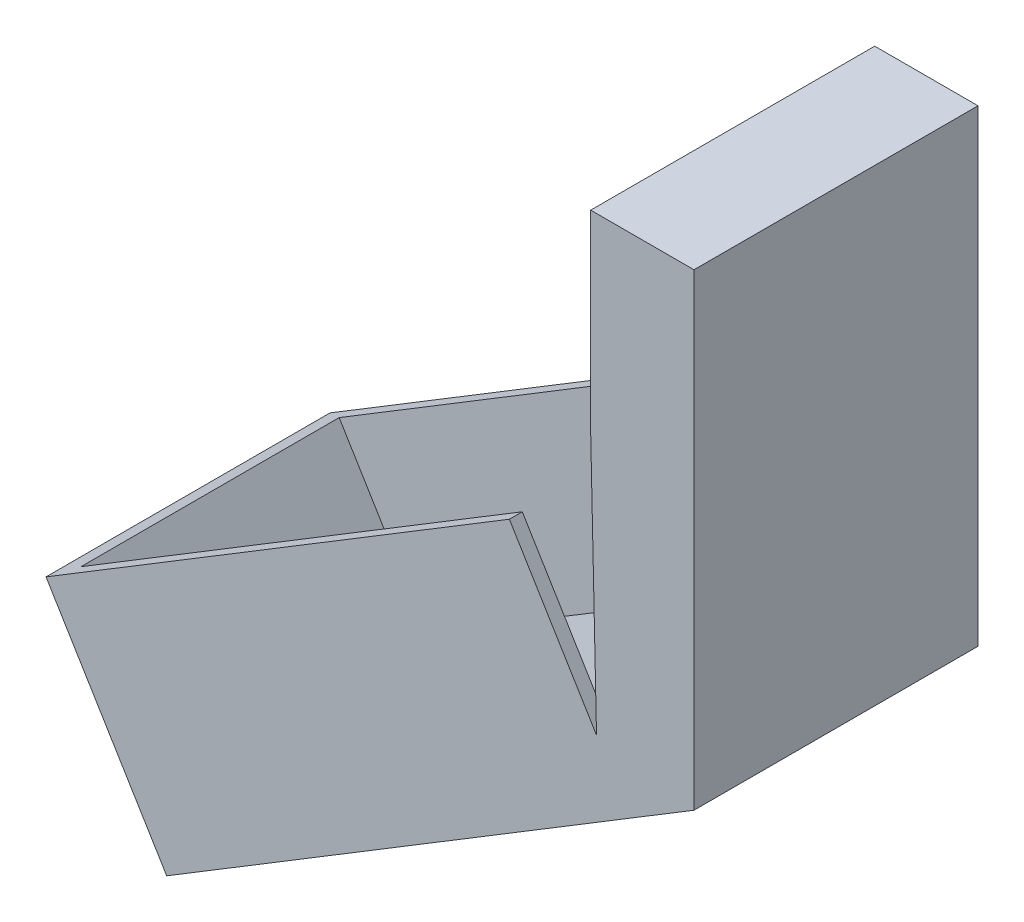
ISO-10303-21;
HEADER;
FILE_DESCRIPTION(('STEP AP214'),'2;1');
FILE_NAME('part.step','',(''),(''),'','','');
FILE_SCHEMA(('AUTOMOTIVE_DESIGN { 1 0 10303 214 1 1 1 1 }'));
ENDSEC;
DATA;
#1=APPLICATION_CONTEXT('core data for automotive mechanical design processes');
#2=APPLICATION_PROTOCOL_DEFINITION('international standard','automotive_design',2000,#1);
#3=PRODUCT_CONTEXT('',#1,'mechanical');
#4=PRODUCT('Part','Part','',(#3));
#5=PRODUCT_RELATED_PRODUCT_CATEGORY('part','',(#4));
#6=PRODUCT_DEFINITION_FORMATION('','',#4);
#7=PRODUCT_DEFINITION_CONTEXT('part definition',#1,'design');
#8=PRODUCT_DEFINITION('design','',#6,#7);
#9=PRODUCT_DEFINITION_SHAPE('','',#8);
#10=(LENGTH_UNIT() NAMED_UNIT(*) SI_UNIT(.MILLI.,.METRE.));
#11=(NAMED_UNIT(*) PLANE_ANGLE_UNIT() SI_UNIT($,.RADIAN.));
#12=(NAMED_UNIT(*) SI_UNIT($,.STERADIAN.) SOLID_ANGLE_UNIT());
#13=UNCERTAINTY_MEASURE_WITH_UNIT(LENGTH_MEASURE(1.E-05),#10,'distance_accuracy_value','');
#14=(GEOMETRIC_REPRESENTATION_CONTEXT(3) GLOBAL_UNCERTAINTY_ASSIGNED_CONTEXT((#13)) GLOBAL_UNIT_ASSIGNED_CONTEXT((#10,
#11,#12)) REPRESENTATION_CONTEXT('',''));
#15=CARTESIAN_POINT('',(0.,0.,0.));
#16=DIRECTION('',(0.,0.,1.));
#17=DIRECTION('',(1.,0.,0.));
#18=AXIS2_PLACEMENT_3D('',#15,#16,#17);
#19=CARTESIAN_POINT('',(0.449712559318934,-19.994943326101,22.));
#20=DIRECTION('',(0.519346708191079,-0.854563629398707,0.));
#21=DIRECTION('',(0.854563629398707,0.519346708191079,0.));
#22=AXIS2_PLACEMENT_3D('',#19,#20,#21);
#23=PLANE('',#22);
#24=DIRECTION('',(-0.854563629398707,-0.519346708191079,0.));
#25=VECTOR('',#24,1.);
#26=CARTESIAN_POINT('',(-33.7328326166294,-40.7688116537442,21.));
#27=LINE('',#26,#25);
#28=CARTESIAN_POINT('',(0.449712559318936,-19.994943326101,21.));
#29=VERTEX_POINT('',#28);
#30=CARTESIAN_POINT('',(-33.7328326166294,-40.7688116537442,21.));
#31=VERTEX_POINT('',#30);
#32=EDGE_CURVE('E157',#29,#31,#27,.T.);
#33=ORIENTED_EDGE('',*,*,#32,.F.);
#34=DIRECTION('',(0.,0.,-1.));
#35=VECTOR('',#34,1.);
#36=CARTESIAN_POINT('',(0.449712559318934,-19.994943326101,22.));
#37=LINE('',#36,#35);
#38=CARTESIAN_POINT('',(0.449712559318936,-19.994943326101,1.));
#39=VERTEX_POINT('',#38);
#40=EDGE_CURVE('E221',#29,#39,#37,.T.);
#41=ORIENTED_EDGE('',*,*,#40,.T.);
#42=DIRECTION('',(0.854563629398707,0.519346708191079,0.));
#43=VECTOR('',#42,1.);
#44=CARTESIAN_POINT('',(0.449712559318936,-19.994943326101,1.));
#45=LINE('',#44,#43);
#46=CARTESIAN_POINT('',(-33.7328326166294,-40.7688116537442,1.));
#47=VERTEX_POINT('',#46);
#48=EDGE_CURVE('E168',#47,#39,#45,.T.);
#49=ORIENTED_EDGE('',*,*,#48,.F.);
#50=DIRECTION('',(0.,0.,-1.));
#51=VECTOR('',#50,1.);
#52=CARTESIAN_POINT('',(-33.7328326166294,-40.7688116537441,22.));
#53=LINE('',#52,#51);
#54=EDGE_CURVE('E220',#31,#47,#53,.T.);
#55=ORIENTED_EDGE('',*,*,#54,.F.);
#56=EDGE_LOOP('',(#33,#41,#49,#55));
#57=FACE_BOUND('',#56,.T.);
#58=ADVANCED_FACE('F37',(#57),#23,.F.);
#59=CARTESIAN_POINT('',(-33.7328326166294,-40.7688116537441,22.));
#60=DIRECTION('',(-0.854563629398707,-0.519346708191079,0.));
#61=DIRECTION('',(0.519346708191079,-0.854563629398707,0.));
#62=AXIS2_PLACEMENT_3D('',#59,#60,#61);
#63=PLANE('',#62);
#64=DIRECTION('',(0.519346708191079,-0.854563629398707,0.));
#65=VECTOR('',#64,1.);
#66=CARTESIAN_POINT('',(-40.4843398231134,-29.659484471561,21.));
#67=LINE('',#66,#65);
#68=CARTESIAN_POINT('',(-40.4843398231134,-29.659484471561,21.));
#69=VERTEX_POINT('',#68);
#70=EDGE_CURVE('E52',#69,#31,#67,.T.);
#71=ORIENTED_EDGE('',*,*,#70,.T.);
#72=ORIENTED_EDGE('',*,*,#54,.T.);
#73=DIRECTION('',(0.519346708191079,-0.854563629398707,0.));
#74=VECTOR('',#73,1.);
#75=CARTESIAN_POINT('',(-40.4843398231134,-29.659484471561,1.));
#76=LINE('',#75,#74);
#77=CARTESIAN_POINT('',(-40.4843398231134,-29.659484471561,1.));
#78=VERTEX_POINT('',#77);
#79=EDGE_CURVE('E177',#78,#47,#76,.T.);
#80=ORIENTED_EDGE('',*,*,#79,.F.);
#81=DIRECTION('',(0.,0.,-1.));
#82=VECTOR('',#81,1.);
#83=CARTESIAN_POINT('',(-40.4843398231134,-29.659484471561,0.));
#84=LINE('',#83,#82);
#85=EDGE_CURVE('E182',#69,#78,#84,.T.);
#86=ORIENTED_EDGE('',*,*,#85,.F.);
#87=EDGE_LOOP('',(#71,#72,#80,#86));
#88=FACE_BOUND('',#87,.T.);
#89=ADVANCED_FACE('F245',(#88),#63,.F.);
#90=CARTESIAN_POINT('',(0.,0.,22.));
#91=DIRECTION('',(0.99974716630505,0.0224856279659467,0.));
#92=DIRECTION('',(-0.0224856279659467,0.99974716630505,0.));
#93=AXIS2_PLACEMENT_3D('',#90,#91,#92);
#94=PLANE('',#93);
#95=DIRECTION('',(0.0224856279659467,-0.99974716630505,0.));
#96=VECTOR('',#95,1.);
#97=CARTESIAN_POINT('',(0.,0.,0.));
#98=LINE('',#97,#96);
#99=CARTESIAN_POINT('',(0.,0.,0.));
#100=VERTEX_POINT('',#99);
#101=CARTESIAN_POINT('',(0.449712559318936,-19.994943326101,0.));
#102=VERTEX_POINT('',#101);
#103=EDGE_CURVE('E202',#100,#102,#98,.T.);
#104=ORIENTED_EDGE('',*,*,#103,.T.);
#105=DIRECTION('',(0.,0.,-1.));
#106=VECTOR('',#105,1.);
#107=CARTESIAN_POINT('',(0.449712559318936,-19.994943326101,0.));
#108=LINE('',#107,#106);
#109=EDGE_CURVE('E151',#39,#102,#108,.T.);
#110=ORIENTED_EDGE('',*,*,#109,.F.);
#111=ORIENTED_EDGE('',*,*,#40,.F.);
#112=CARTESIAN_POINT('',(0.449712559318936,-19.994943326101,22.));
#113=VERTEX_POINT('',#112);
#114=EDGE_CURVE('E45',#113,#29,#37,.T.);
#115=ORIENTED_EDGE('',*,*,#114,.F.);
#116=DIRECTION('',(0.0224856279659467,-0.99974716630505,0.));
#117=VECTOR('',#116,1.);
#118=CARTESIAN_POINT('',(0.,0.,22.));
#119=LINE('',#118,#117);
#120=CARTESIAN_POINT('',(0.,0.,22.));
#121=VERTEX_POINT('',#120);
#122=EDGE_CURVE('E84',#121,#113,#119,.T.);
#123=ORIENTED_EDGE('',*,*,#122,.F.);
#124=DIRECTION('',(0.,0.,-1.));
#125=VECTOR('',#124,1.);
#126=CARTESIAN_POINT('',(0.,0.,22.));
#127=LINE('',#126,#125);
#128=EDGE_CURVE('E11',#121,#100,#127,.T.);
#129=ORIENTED_EDGE('',*,*,#128,.T.);
#130=EDGE_LOOP('',(#104,#110,#111,#115,#123,#129));
#131=FACE_BOUND('',#130,.T.);
#132=ADVANCED_FACE('F39',(#131),#94,.F.);
#133=CARTESIAN_POINT('',(-37.,-39.2438141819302,22.));
#134=DIRECTION('',(0.854563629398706,0.51934670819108,0.));
#135=DIRECTION('',(-0.51934670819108,0.854563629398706,0.));
#136=AXIS2_PLACEMENT_3D('',#133,#134,#135);
#137=PLANE('',#136);
#138=DIRECTION('',(0.51934670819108,-0.854563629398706,0.));
#139=VECTOR('',#138,1.);
#140=CARTESIAN_POINT('',(-37.,-39.2438141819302,0.));
#141=LINE('',#140,#139);
#142=CARTESIAN_POINT('',(-42.1934670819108,-30.6981778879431,0.));
#143=VERTEX_POINT('',#142);
#144=CARTESIAN_POINT('',(-32.8452263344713,-46.0803232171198,0.));
#145=VERTEX_POINT('',#144);
#146=EDGE_CURVE('E213',#143,#145,#141,.T.);
#147=ORIENTED_EDGE('',*,*,#146,.T.);
#148=DIRECTION('',(0.,0.,-1.));
#149=VECTOR('',#148,1.);
#150=CARTESIAN_POINT('',(-32.8452263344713,-46.0803232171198,22.));
#151=LINE('',#150,#149);
#152=CARTESIAN_POINT('',(-32.8452263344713,-46.0803232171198,22.));
#153=VERTEX_POINT('',#152);
#154=EDGE_CURVE('E218',#153,#145,#151,.T.);
#155=ORIENTED_EDGE('',*,*,#154,.F.);
#156=DIRECTION('',(0.51934670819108,-0.854563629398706,0.));
#157=VECTOR('',#156,1.);
#158=CARTESIAN_POINT('',(-37.,-39.2438141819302,22.));
#159=LINE('',#158,#157);
#160=CARTESIAN_POINT('',(-42.1934670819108,-30.6981778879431,22.));
#161=VERTEX_POINT('',#160);
#162=EDGE_CURVE('E204',#161,#153,#159,.T.);
#163=ORIENTED_EDGE('',*,*,#162,.F.);
#164=DIRECTION('',(0.,0.,1.));
#165=VECTOR('',#164,1.);
#166=CARTESIAN_POINT('',(-42.1934670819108,-30.6981778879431,0.));
#167=LINE('',#166,#165);
#168=EDGE_CURVE('E145',#143,#161,#167,.T.);
#169=ORIENTED_EDGE('',*,*,#168,.F.);
#170=EDGE_LOOP('',(#147,#155,#163,#169));
#171=FACE_BOUND('',#170,.T.);
#172=ADVANCED_FACE('F252',(#171),#137,.F.);
#173=CARTESIAN_POINT('',(-32.8452263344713,-46.0803232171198,22.));
#174=DIRECTION('',(-0.519346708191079,0.854563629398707,0.));
#175=DIRECTION('',(-0.854563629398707,-0.519346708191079,0.));
#176=AXIS2_PLACEMENT_3D('',#173,#174,#175);
#177=PLANE('',#176);
#178=DIRECTION('',(0.854563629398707,0.519346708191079,0.));
#179=VECTOR('',#178,1.);
#180=CARTESIAN_POINT('',(-32.8452263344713,-46.0803232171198,0.));
#181=LINE('',#180,#179);
#182=CARTESIAN_POINT('',(8.,-21.2573221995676,0.));
#183=VERTEX_POINT('',#182);
#184=EDGE_CURVE('E78',#145,#183,#181,.T.);
#185=ORIENTED_EDGE('',*,*,#184,.T.);
#186=DIRECTION('',(0.,0.,-1.));
#187=VECTOR('',#186,1.);
#188=CARTESIAN_POINT('',(8.,-21.2573221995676,22.));
#189=LINE('',#188,#187);
#190=CARTESIAN_POINT('',(8.,-21.2573221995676,22.));
#191=VERTEX_POINT('',#190);
#192=EDGE_CURVE('E210',#191,#183,#189,.T.);
#193=ORIENTED_EDGE('',*,*,#192,.F.);
#194=DIRECTION('',(0.854563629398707,0.519346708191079,0.));
#195=VECTOR('',#194,1.);
#196=CARTESIAN_POINT('',(-32.8452263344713,-46.0803232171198,22.));
#197=LINE('',#196,#195);
#198=EDGE_CURVE('E61',#153,#191,#197,.T.);
#199=ORIENTED_EDGE('',*,*,#198,.F.);
#200=ORIENTED_EDGE('',*,*,#154,.T.);
#201=EDGE_LOOP('',(#185,#193,#199,#200));
#202=FACE_BOUND('',#201,.T.);
#203=ADVANCED_FACE('F256',(#202),#177,.F.);
#204=CARTESIAN_POINT('',(8.,-21.2573221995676,22.));
#205=DIRECTION('',(-1.,0.,0.));
#206=DIRECTION('',(0.,0.,1.));
#207=AXIS2_PLACEMENT_3D('',#204,#205,#206);
#208=PLANE('',#207);
#209=DIRECTION('',(0.,1.,0.));
#210=VECTOR('',#209,1.);
#211=CARTESIAN_POINT('',(8.,-21.2573221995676,0.));
#212=LINE('',#211,#210);
#213=CARTESIAN_POINT('',(8.,15.,0.));
#214=VERTEX_POINT('',#213);
#215=EDGE_CURVE('E205',#183,#214,#212,.T.);
#216=ORIENTED_EDGE('',*,*,#215,.T.);
#217=DIRECTION('',(0.,0.,-1.));
#218=VECTOR('',#217,1.);
#219=CARTESIAN_POINT('',(8.,15.,0.));
#220=LINE('',#219,#218);
#221=CARTESIAN_POINT('',(8.,15.,22.));
#222=VERTEX_POINT('',#221);
#223=EDGE_CURVE('E192',#222,#214,#220,.T.);
#224=ORIENTED_EDGE('',*,*,#223,.F.);
#225=DIRECTION('',(0.,1.,0.));
#226=VECTOR('',#225,1.);
#227=CARTESIAN_POINT('',(8.,-21.2573221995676,22.));
#228=LINE('',#227,#226);
#229=EDGE_CURVE('E208',#191,#222,#228,.T.);
#230=ORIENTED_EDGE('',*,*,#229,.F.);
#231=ORIENTED_EDGE('',*,*,#192,.T.);
#232=EDGE_LOOP('',(#216,#224,#230,#231));
#233=FACE_BOUND('',#232,.T.);
#234=ADVANCED_FACE('F260',(#233),#208,.F.);
#235=CARTESIAN_POINT('',(0.,0.,22.));
#236=DIRECTION('',(0.,0.,-1.));
#237=DIRECTION('',(-1.,0.,0.));
#238=AXIS2_PLACEMENT_3D('',#235,#236,#237);
#239=PLANE('',#238);
#240=DIRECTION('',(0.519346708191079,-0.854563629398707,0.));
#241=VECTOR('',#240,1.);
#242=CARTESIAN_POINT('',(-6.30179464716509,-8.88561614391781,22.));
#243=LINE('',#242,#241);
#244=CARTESIAN_POINT('',(-6.30179464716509,-8.88561614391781,22.));
#245=VERTEX_POINT('',#244);
#246=EDGE_CURVE('E148',#245,#113,#243,.T.);
#247=ORIENTED_EDGE('',*,*,#246,.F.);
#248=DIRECTION('',(0.854563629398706,0.519346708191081,0.));
#249=VECTOR('',#248,1.);
#250=CARTESIAN_POINT('',(-40.4843398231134,-29.659484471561,22.));
#251=LINE('',#250,#249);
#252=EDGE_CURVE('E137',#161,#245,#251,.T.);
#253=ORIENTED_EDGE('',*,*,#252,.F.);
#254=ORIENTED_EDGE('',*,*,#162,.T.);
#255=ORIENTED_EDGE('',*,*,#198,.T.);
#256=ORIENTED_EDGE('',*,*,#229,.T.);
#257=DIRECTION('',(1.,0.,0.));
#258=VECTOR('',#257,1.);
#259=CARTESIAN_POINT('',(0.,15.,22.));
#260=LINE('',#259,#258);
#261=CARTESIAN_POINT('',(0.,15.,22.));
#262=VERTEX_POINT('',#261);
#263=EDGE_CURVE('E189',#262,#222,#260,.T.);
#264=ORIENTED_EDGE('',*,*,#263,.F.);
#265=DIRECTION('',(0.,-1.,0.));
#266=VECTOR('',#265,1.);
#267=CARTESIAN_POINT('',(0.,15.,22.));
#268=LINE('',#267,#266);
#269=EDGE_CURVE('E200',#262,#121,#268,.T.);
#270=ORIENTED_EDGE('',*,*,#269,.T.);
#271=ORIENTED_EDGE('',*,*,#122,.T.);
#272=EDGE_LOOP('',(#247,#253,#254,#255,#256,#264,#270,#271));
#273=FACE_BOUND('',#272,.T.);
#274=ADVANCED_FACE('F149',(#273),#239,.F.);
#275=CARTESIAN_POINT('',(0.,0.,0.));
#276=DIRECTION('',(0.,0.,-1.));
#277=DIRECTION('',(-1.,0.,0.));
#278=AXIS2_PLACEMENT_3D('',#275,#276,#277);
#279=PLANE('',#278);
#280=DIRECTION('',(-0.854563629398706,-0.519346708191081,0.));
#281=VECTOR('',#280,1.);
#282=CARTESIAN_POINT('',(-40.4843398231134,-29.659484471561,0.));
#283=LINE('',#282,#281);
#284=CARTESIAN_POINT('',(-6.30179464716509,-8.88561614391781,0.));
#285=VERTEX_POINT('',#284);
#286=EDGE_CURVE('E184',#285,#143,#283,.T.);
#287=ORIENTED_EDGE('',*,*,#286,.F.);
#288=DIRECTION('',(0.519346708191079,-0.854563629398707,0.));
#289=VECTOR('',#288,1.);
#290=CARTESIAN_POINT('',(-6.30179464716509,-8.88561614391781,0.));
#291=LINE('',#290,#289);
#292=EDGE_CURVE('E180',#285,#102,#291,.T.);
#293=ORIENTED_EDGE('',*,*,#292,.T.);
#294=ORIENTED_EDGE('',*,*,#103,.F.);
#295=DIRECTION('',(0.,-1.,0.));
#296=VECTOR('',#295,1.);
#297=CARTESIAN_POINT('',(0.,15.,0.));
#298=LINE('',#297,#296);
#299=CARTESIAN_POINT('',(0.,15.,0.));
#300=VERTEX_POINT('',#299);
#301=EDGE_CURVE('E197',#300,#100,#298,.T.);
#302=ORIENTED_EDGE('',*,*,#301,.F.);
#303=DIRECTION('',(-1.,0.,0.));
#304=VECTOR('',#303,1.);
#305=CARTESIAN_POINT('',(0.,15.,0.));
#306=LINE('',#305,#304);
#307=EDGE_CURVE('E195',#214,#300,#306,.T.);
#308=ORIENTED_EDGE('',*,*,#307,.F.);
#309=ORIENTED_EDGE('',*,*,#215,.F.);
#310=ORIENTED_EDGE('',*,*,#184,.F.);
#311=ORIENTED_EDGE('',*,*,#146,.F.);
#312=EDGE_LOOP('',(#287,#293,#294,#302,#308,#309,#310,#311));
#313=FACE_BOUND('',#312,.T.);
#314=ADVANCED_FACE('F240',(#313),#279,.T.);
#315=CARTESIAN_POINT('',(0.,15.,0.));
#316=DIRECTION('',(1.,0.,0.));
#317=DIRECTION('',(0.,1.,0.));
#318=AXIS2_PLACEMENT_3D('',#315,#316,#317);
#319=PLANE('',#318);
#320=ORIENTED_EDGE('',*,*,#128,.F.);
#321=ORIENTED_EDGE('',*,*,#269,.F.);
#322=DIRECTION('',(0.,0.,1.));
#323=VECTOR('',#322,1.);
#324=CARTESIAN_POINT('',(0.,15.,0.));
#325=LINE('',#324,#323);
#326=EDGE_CURVE('E146',#300,#262,#325,.T.);
#327=ORIENTED_EDGE('',*,*,#326,.F.);
#328=ORIENTED_EDGE('',*,*,#301,.T.);
#329=EDGE_LOOP('',(#320,#321,#327,#328));
#330=FACE_BOUND('',#329,.T.);
#331=ADVANCED_FACE('F266',(#330),#319,.F.);
#332=CARTESIAN_POINT('',(0.,15.,0.));
#333=DIRECTION('',(0.,1.,0.));
#334=DIRECTION('',(-1.,0.,0.));
#335=AXIS2_PLACEMENT_3D('',#332,#333,#334);
#336=PLANE('',#335);
#337=ORIENTED_EDGE('',*,*,#326,.T.);
#338=ORIENTED_EDGE('',*,*,#263,.T.);
#339=ORIENTED_EDGE('',*,*,#223,.T.);
#340=ORIENTED_EDGE('',*,*,#307,.T.);
#341=EDGE_LOOP('',(#337,#338,#339,#340));
#342=FACE_BOUND('',#341,.T.);
#343=ADVANCED_FACE('F271',(#342),#336,.T.);
#344=CARTESIAN_POINT('',(2.24384164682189,-3.69214906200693,0.));
#345=DIRECTION('',(0.519346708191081,-0.854563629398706,0.));
#346=DIRECTION('',(0.854563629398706,0.519346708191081,0.));
#347=AXIS2_PLACEMENT_3D('',#344,#345,#346);
#348=PLANE('',#347);
#349=ORIENTED_EDGE('',*,*,#252,.T.);
#350=DIRECTION('',(0.,0.,-1.));
#351=VECTOR('',#350,1.);
#352=CARTESIAN_POINT('',(-6.30179464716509,-8.88561614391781,22.));
#353=LINE('',#352,#351);
#354=CARTESIAN_POINT('',(-6.30179464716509,-8.88561614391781,21.));
#355=VERTEX_POINT('',#354);
#356=EDGE_CURVE('E141',#245,#355,#353,.T.);
#357=ORIENTED_EDGE('',*,*,#356,.T.);
#358=DIRECTION('',(-0.854563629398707,-0.519346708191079,0.));
#359=VECTOR('',#358,1.);
#360=CARTESIAN_POINT('',(-40.4843398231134,-29.659484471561,21.));
#361=LINE('',#360,#359);
#362=EDGE_CURVE('E156',#355,#69,#361,.T.);
#363=ORIENTED_EDGE('',*,*,#362,.T.);
#364=ORIENTED_EDGE('',*,*,#85,.T.);
#365=DIRECTION('',(0.854563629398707,0.519346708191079,0.));
#366=VECTOR('',#365,1.);
#367=CARTESIAN_POINT('',(-6.30179464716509,-8.88561614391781,1.));
#368=LINE('',#367,#366);
#369=CARTESIAN_POINT('',(-6.30179464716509,-8.88561614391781,1.));
#370=VERTEX_POINT('',#369);
#371=EDGE_CURVE('E167',#78,#370,#368,.T.);
#372=ORIENTED_EDGE('',*,*,#371,.T.);
#373=DIRECTION('',(0.,0.,-1.));
#374=VECTOR('',#373,1.);
#375=CARTESIAN_POINT('',(-6.30179464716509,-8.88561614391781,0.));
#376=LINE('',#375,#374);
#377=EDGE_CURVE('E164',#370,#285,#376,.T.);
#378=ORIENTED_EDGE('',*,*,#377,.T.);
#379=ORIENTED_EDGE('',*,*,#286,.T.);
#380=ORIENTED_EDGE('',*,*,#168,.T.);
#381=EDGE_LOOP('',(#349,#357,#363,#364,#372,#378,#379,#380));
#382=FACE_BOUND('',#381,.T.);
#383=ADVANCED_FACE('F139',(#382),#348,.F.);
#384=CARTESIAN_POINT('',(-6.30179464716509,-8.88561614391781,0.));
#385=DIRECTION('',(-0.854563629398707,-0.519346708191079,0.));
#386=DIRECTION('',(0.519346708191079,-0.854563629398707,0.));
#387=AXIS2_PLACEMENT_3D('',#384,#385,#386);
#388=PLANE('',#387);
#389=ORIENTED_EDGE('',*,*,#109,.T.);
#390=ORIENTED_EDGE('',*,*,#292,.F.);
#391=ORIENTED_EDGE('',*,*,#377,.F.);
#392=DIRECTION('',(0.519346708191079,-0.854563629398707,0.));
#393=VECTOR('',#392,1.);
#394=CARTESIAN_POINT('',(-6.30179464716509,-8.88561614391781,1.));
#395=LINE('',#394,#393);
#396=EDGE_CURVE('E170',#370,#39,#395,.T.);
#397=ORIENTED_EDGE('',*,*,#396,.T.);
#398=EDGE_LOOP('',(#389,#390,#391,#397));
#399=FACE_BOUND('',#398,.T.);
#400=ADVANCED_FACE('F235',(#399),#388,.F.);
#401=CARTESIAN_POINT('',(-6.30179464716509,-8.88561614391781,1.));
#402=DIRECTION('',(0.,0.,-1.));
#403=DIRECTION('',(-1.,0.,0.));
#404=AXIS2_PLACEMENT_3D('',#401,#402,#403);
#405=PLANE('',#404);
#406=ORIENTED_EDGE('',*,*,#48,.T.);
#407=ORIENTED_EDGE('',*,*,#396,.F.);
#408=ORIENTED_EDGE('',*,*,#371,.F.);
#409=ORIENTED_EDGE('',*,*,#79,.T.);
#410=EDGE_LOOP('',(#406,#407,#408,#409));
#411=FACE_BOUND('',#410,.T.);
#412=ADVANCED_FACE('F230',(#411),#405,.F.);
#413=CARTESIAN_POINT('',(-6.30179464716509,-8.88561614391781,22.));
#414=DIRECTION('',(-0.854563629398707,-0.519346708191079,0.));
#415=DIRECTION('',(0.519346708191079,-0.854563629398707,0.));
#416=AXIS2_PLACEMENT_3D('',#413,#414,#415);
#417=PLANE('',#416);
#418=ORIENTED_EDGE('',*,*,#114,.T.);
#419=DIRECTION('',(0.519346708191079,-0.854563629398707,0.));
#420=VECTOR('',#419,1.);
#421=CARTESIAN_POINT('',(-6.30179464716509,-8.88561614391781,21.));
#422=LINE('',#421,#420);
#423=EDGE_CURVE('E152',#355,#29,#422,.T.);
#424=ORIENTED_EDGE('',*,*,#423,.F.);
#425=ORIENTED_EDGE('',*,*,#356,.F.);
#426=ORIENTED_EDGE('',*,*,#246,.T.);
#427=EDGE_LOOP('',(#418,#424,#425,#426));
#428=FACE_BOUND('',#427,.T.);
#429=ADVANCED_FACE('F154',(#428),#417,.F.);
#430=CARTESIAN_POINT('',(-40.4843398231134,-29.659484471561,21.));
#431=DIRECTION('',(0.,0.,1.));
#432=DIRECTION('',(1.,0.,0.));
#433=AXIS2_PLACEMENT_3D('',#430,#431,#432);
#434=PLANE('',#433);
#435=ORIENTED_EDGE('',*,*,#32,.T.);
#436=ORIENTED_EDGE('',*,*,#70,.F.);
#437=ORIENTED_EDGE('',*,*,#362,.F.);
#438=ORIENTED_EDGE('',*,*,#423,.T.);
#439=EDGE_LOOP('',(#435,#436,#437,#438));
#440=FACE_BOUND('',#439,.T.);
#441=ADVANCED_FACE('F284',(#440),#434,.F.);
#442=CLOSED_SHELL('',(#58,#89,#132,#172,#203,#234,#274,#314,#331,#343,#383,#400,#412,#429,#441));
#443=MANIFOLD_SOLID_BREP('B2',#442);
#444=ADVANCED_BREP_SHAPE_REPRESENTATION('',(#18,#443),#14);
#445=SHAPE_DEFINITION_REPRESENTATION(#9,#444);
ENDSEC;
END-ISO-10303-21;
